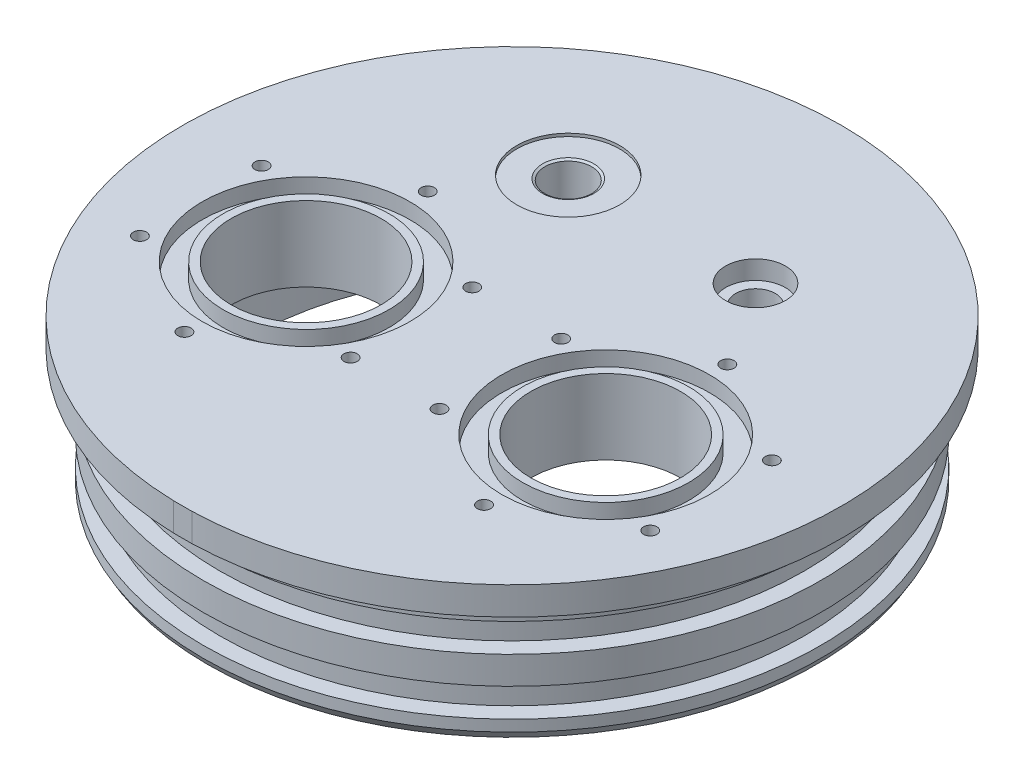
from build123d import *

# Parameters (mm, degrees)
CUT_EXTRUDE1_START       = -12.7
SKETCH4_OUTSIDE_W        = 145.776
SKETCH4_OUTSIDE_H        = 145.776
SKETCH4_OUTSIDE_R        = 49.5681
CUT_EXTRUDE1_DEPTH       = 4.826
CUT_EXTRUDE2_START       = -3.175
SKETCH5_OUTSIDE_W        = 145.776
SKETCH5_OUTSIDE_H        = 145.776
SKETCH5_OUTSIDE_R        = 49.5681
CUT_EXTRUDE2_DEPTH       = 4.826
CHAMFER1_SIZE            = 1.27
CHAMFER1_SIZE2           = 0.733234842
SKETCH6_R                = 12.7
CUT_EXTRUDE3_DEPTH       = 84.007883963
SKETCH7_R                = 44.45
CUT_EXTRUDE4_DEPTH       = 12.7
SKETCH8_R                = 17.6149
SKETCH8_R_2              = 14.0843
CUT_EXTRUDE5_DEPTH       = 2.6416
SKETCH9_R                = 17.6149
SKETCH9_R_2              = 14.0843
CUT_EXTRUDE6_DEPTH       = 2.6416
SKETCH10_R               = 1.1303
CUT_EXTRUDE7_DEPTH       = 9.525
CIRPATTERN1_COUNT        = 6
SKETCH12_R               = 1.1303
CUT_EXTRUDE8_DEPTH       = 9.525
CIRPATTERN2_COUNT        = 6
SKETCH14_R               = 3.365497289
CUT_EXTRUDE10_DEPTH      = 84.007883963
SKETCH15_R               = 5.08
CUT_EXTRUDE11_DEPTH      = 3.175
SKETCH16_R               = 3.9624
CUT_EXTRUDE12_DEPTH      = 84.007883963
CHAMFER2_SIZE            = 1.27
CHAMFER2_SIZE2           = 0.733234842
SKETCH17_R               = 8.7249
CUT_EXTRUDE13_DEPTH      = 0.508
CUT_EXTRUDE14_DEPTH      = 84.007883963
CUT_EXTRUDE14_DEPTH_BACK = 84.007883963


with BuildPart() as part:
    # Sketch3 → Revolve1 (revolve)
    with BuildSketch(Plane.XY, mode=Mode.PRIVATE) as revolve1_sk:
        Polygon((0, 0), (52.3621, 0), (52.3621, 20.6502), (55.88, 20.6502), (55.88, 25.4), (0, 25.4), align=None)
    revolve(revolve1_sk.sketch.rotate(Axis((0, 0, 0), (0, 1, 0)), 90), axis=Axis((0, 0, 0), (0, 1, 0)))

    # Sketch4 outside → Cut-Extrude1 (cut)
    with BuildSketch(Plane.XZ.offset(CUT_EXTRUDE1_START)):
        Rectangle(SKETCH4_OUTSIDE_W, SKETCH4_OUTSIDE_H)
        with Locations(Location((0, 0, 0), (0, 0, 270))):
            Circle(SKETCH4_OUTSIDE_R, mode=Mode.SUBTRACT)
    extrude(amount=-CUT_EXTRUDE1_DEPTH, mode=Mode.SUBTRACT)

    # Sketch5 outside → Cut-Extrude2 (cut)
    with BuildSketch(Plane.XZ.offset(CUT_EXTRUDE2_START)):
        Rectangle(SKETCH5_OUTSIDE_W, SKETCH5_OUTSIDE_H)
        with Locations(Location((0, 0, 0), (0, 0, 270))):
            Circle(SKETCH5_OUTSIDE_R, mode=Mode.SUBTRACT)
    extrude(amount=-CUT_EXTRUDE2_DEPTH, mode=Mode.SUBTRACT)

    # Chamfer1
    chamfer1_edges = [part.edges().sort_by_distance(p)[0] for p in [
        (0, 0, 52.3621),
    ]]
    chamfer1_side = [part.faces().sort_by_distance(p)[0] for p in [
        (0, 1.5875, 52.3621),
    ]]
    chamfer(chamfer1_edges, length=CHAMFER1_SIZE, length2=CHAMFER1_SIZE2, reference=chamfer1_side[0])

    # Sketch6 → Cut-Extrude3 (cut, through all)
    with BuildSketch(Plane(origin=(0, 25.4, 0), x_dir=(1, 0, 0), z_dir=(0, 1, 0))):
        with Locations(Location((25.4, -9.525, 0), (0, 0, 270))):
            Circle(SKETCH6_R)
        with Locations(Location((-25.4, -9.525, 0), (0, 0, 270))):
            Circle(SKETCH6_R)
    extrude(amount=-CUT_EXTRUDE3_DEPTH, mode=Mode.SUBTRACT)

    # Sketch7 → Cut-Extrude4 (cut)
    with BuildSketch(Plane.XZ):
        with Locations(Location((0, 0, 0), (0, 0, 270))):
            Circle(SKETCH7_R)
    extrude(amount=-CUT_EXTRUDE4_DEPTH, mode=Mode.SUBTRACT)

    # Sketch8 → Cut-Extrude5 (cut)
    with BuildSketch(Plane(origin=(0, 25.4, 0), x_dir=(1, 0, 0), z_dir=(0, 1, 0))):
        with Locations(Location((-25.4, -9.525, 0), (0, 0, 270))):
            Circle(SKETCH8_R)
        with Locations(Location((-25.4, -9.525, 0), (0, 0, 270))):
            Circle(SKETCH8_R_2, mode=Mode.SUBTRACT)
    extrude(amount=-CUT_EXTRUDE5_DEPTH, mode=Mode.SUBTRACT)

    # Sketch9 → Cut-Extrude6 (cut)
    with BuildSketch(Plane(origin=(0, 25.4, 0), x_dir=(1, 0, 0), z_dir=(0, 1, 0))):
        with Locations(Location((25.4, -9.525, 0), (0, 0, 270))):
            Circle(SKETCH9_R)
        with Locations(Location((25.4, -9.525, 0), (0, 0, 270))):
            Circle(SKETCH9_R_2, mode=Mode.SUBTRACT)
    extrude(amount=-CUT_EXTRUDE6_DEPTH, mode=Mode.SUBTRACT)

    # Sketch10 → Cut-Extrude7 (cut)
    with BuildSketch(Plane(origin=(0, 25.4, 0), x_dir=(1, 0, 0), z_dir=(0, 1, 0))):
        with Locations(Location((-25.4, 11.0998, 0), (0, 0, 270))):
            Circle(SKETCH10_R)
    cut_extrude7 = extrude(amount=-CUT_EXTRUDE7_DEPTH, mode=Mode.SUBTRACT)

    # CirPattern1: Cut-Extrude7 ×6 about axis
    cirpattern1_axis = Axis((-25.4, 0, 9.525), (0, 1, 0))
    for i in range(1, CIRPATTERN1_COUNT):
        add(cut_extrude7.rotate(cirpattern1_axis, i * 360 / CIRPATTERN1_COUNT), mode=Mode.SUBTRACT)

    # Sketch12 → Cut-Extrude8 (cut)
    with BuildSketch(Plane(origin=(0, 25.4, 0), x_dir=(1, 0, 0), z_dir=(0, 1, 0))):
        with Locations(Location((25.4, 11.0998, 0), (0, 0, 270))):
            Circle(SKETCH12_R)
    cut_extrude8 = extrude(amount=-CUT_EXTRUDE8_DEPTH, mode=Mode.SUBTRACT)

    # CirPattern2: Cut-Extrude8 ×6 about axis
    cirpattern2_axis = Axis((25.4, 0, 9.525), (0, 1, 0))
    for i in range(1, CIRPATTERN2_COUNT):
        add(cut_extrude8.rotate(cirpattern2_axis, i * 360 / CIRPATTERN2_COUNT), mode=Mode.SUBTRACT)

    # Sketch14 → Cut-Extrude10 (cut, through all)
    with BuildSketch(Plane(origin=(0, 25.4, 0), x_dir=(1, 0, 0), z_dir=(0, 1, 0))):
        with Locations(Location((15.875, 25.4, 0), (0, 0, 270))):
            Circle(SKETCH14_R)
    extrude(amount=-CUT_EXTRUDE10_DEPTH, mode=Mode.SUBTRACT)

    # Sketch15 → Cut-Extrude11 (cut)
    with BuildSketch(Plane(origin=(0, 25.4, 0), x_dir=(1, 0, 0), z_dir=(0, 1, 0))):
        with Locations(Location((15.875, 25.4, 0), (0, 0, 270))):
            Circle(SKETCH15_R)
    extrude(amount=-CUT_EXTRUDE11_DEPTH, mode=Mode.SUBTRACT)

    # Sketch16 → Cut-Extrude12 (cut, through all)
    with BuildSketch(Plane(origin=(0, 25.4, 0), x_dir=(1, 0, 0), z_dir=(0, 1, 0))):
        with Locations(Location((-15.875, 25.4, 0), (0, 0, 270))):
            Circle(SKETCH16_R)
    extrude(amount=-CUT_EXTRUDE12_DEPTH, mode=Mode.SUBTRACT)

    # Chamfer2
    chamfer2_edges = [part.edges().sort_by_distance(p)[0] for p in [
        (-15.875, 25.4, -29.3624),
    ]]
    chamfer2_side = [part.faces().sort_by_distance(p)[0] for p in [
        (-0.065610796, 25.4, -2.045943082),
    ]]
    chamfer(chamfer2_edges, length=CHAMFER2_SIZE, length2=CHAMFER2_SIZE2, reference=chamfer2_side[0])

    # Sketch17 → Cut-Extrude13 (cut)
    with BuildSketch(Plane(origin=(0, 25.4, 0), x_dir=(1, 0, 0), z_dir=(0, 1, 0))):
        with Locations(Location((-15.875, 25.4, 0), (0, 0, 270))):
            Circle(SKETCH17_R)
    extrude(amount=-CUT_EXTRUDE13_DEPTH, mode=Mode.SUBTRACT)

    # Sketch18 → Cut-Extrude14 (cut, two sides: drawn at the far end of the back side and taken through both)
    with BuildSketch(Plane(origin=(0, 25.4, 0), x_dir=(1, 0, 0), z_dir=(0, 1, 0)).offset(-CUT_EXTRUDE14_DEPTH_BACK)):
        Polygon((-262.862612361, -55.857805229), (-1.5748, -55.857805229), (1.5748, -55.857805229), (262.862612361, -55.857805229), (262.862612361, -578.433429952), (-262.862612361, -578.433429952), align=None)
    extrude(amount=CUT_EXTRUDE14_DEPTH + CUT_EXTRUDE14_DEPTH_BACK, mode=Mode.SUBTRACT)


solid = part.part
